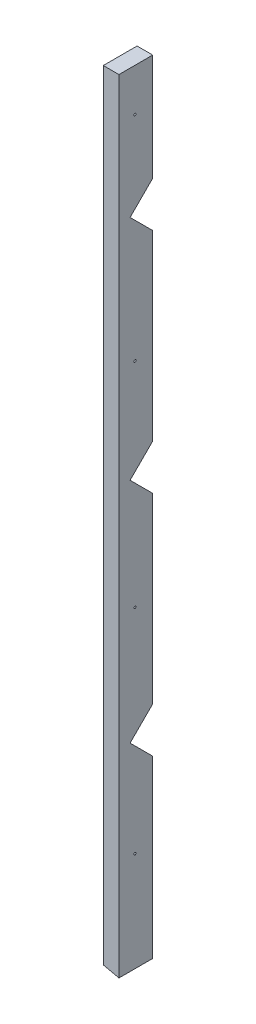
from build123d import *

# Parameters (mm, degrees)
SKETCH1_W                          = 22
SKETCH1_H                          = 47.5
EXTRUDE_H_JD_DEPTH                 = 1100
CUT_ROMBISKT_REGELUTTAG_DEPTH      = 1102.244863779
CUT_SKRUVH_L_REACH                 = 1103.245
SKETCH3_R                          = 1.5
CUT_SNEDKAP_BOTTEN_DEPTH           = 1102.244863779
CUT_SNEDKAP_BOTTEN_DEPTH_BACK      = 1102.244863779
LPATTERN_ROMBISKT_REGELUTTAG_COUNT = 3
LPATTERN_ROMBISKT_REGELUTTAG_PITCH = 320
LPATTERN_SKRUVH_L_COUNT            = 4
LPATTERN_SKRUVH_L_PITCH            = 300


with BuildPart() as part:
    # Sketch1 → Extrude h_jd (new body)
    with BuildSketch(Plane(origin=(0, 0, 0), x_dir=(1, 0, 0), z_dir=(0, 1, 0))):
        with Locations((11, -23.75)):
            Rectangle(SKETCH1_W, SKETCH1_H)
    extrude(amount=EXTRUDE_H_JD_DEPTH)

    # Sketch2 → Cut rombiskt regeluttag (cut, through all)
    with BuildSketch(Plane(origin=(0, 0, 0), x_dir=(0, 0, -1), z_dir=(1, 0, 0))):
        Polygon((-886.360389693, 0), (-918.180194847, -31.819805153), (-950, 0), (-918.180194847, 31.819805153), align=None)
        Polygon((-31.819805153, 918.180194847), (0, 886.360389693), (31.819805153, 918.180194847), (0, 950), align=None)
    cut_rombiskt_regeluttag = extrude(amount=CUT_ROMBISKT_REGELUTTAG_DEPTH, mode=Mode.SUBTRACT)

    # Sketch3 → Cut skruvh_l (cut, up to next)
    with BuildSketch(Plane(origin=(0, 0, 0), x_dir=(0, 0, -1), z_dir=(1, 0, 0)), mode=Mode.PRIVATE) as cut_skruvh_l_sk1:
        with Locations(Location((-25, 1040, 0), (0, 0, 180))):
            Circle(SKETCH3_R)
    cut_skruvh_l_tool1 = extrude(cut_skruvh_l_sk1.sketch, amount=CUT_SKRUVH_L_REACH, mode=Mode.PRIVATE) & part.part
    cut_skruvh_l = cut_skruvh_l_tool1.solids().sort_by_distance((0, 1040, 25))[0]
    add(cut_skruvh_l, mode=Mode.SUBTRACT)

    # Sketch4 → Cut snedkap botten (cut, two sides: drawn at the far end of the back side and taken through both)
    with BuildSketch(Plane.XY.offset(-CUT_SNEDKAP_BOTTEN_DEPTH_BACK)):
        Polygon((-2155.472626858, 494.880142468), (0, 5), (22, 0), (2177.472626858, -489.880142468), (1197.712341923, -4800.825396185), (-3135.232911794, -3816.065111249), align=None)
    extrude(amount=CUT_SNEDKAP_BOTTEN_DEPTH + CUT_SNEDKAP_BOTTEN_DEPTH_BACK, mode=Mode.SUBTRACT)

    # LPattern rombiskt regeluttag: Cut rombiskt regeluttag ×3
    with Locations(*[(0, -i * LPATTERN_ROMBISKT_REGELUTTAG_PITCH, 0) for i in range(1, LPATTERN_ROMBISKT_REGELUTTAG_COUNT)]):
        add(cut_rombiskt_regeluttag, mode=Mode.SUBTRACT)

    # LPattern skruvh_l: Cut skruvh_l ×4
    with Locations(*[(0, -i * LPATTERN_SKRUVH_L_PITCH, 0) for i in range(1, LPATTERN_SKRUVH_L_COUNT)]):
        add(cut_skruvh_l, mode=Mode.SUBTRACT)


solid = part.part
